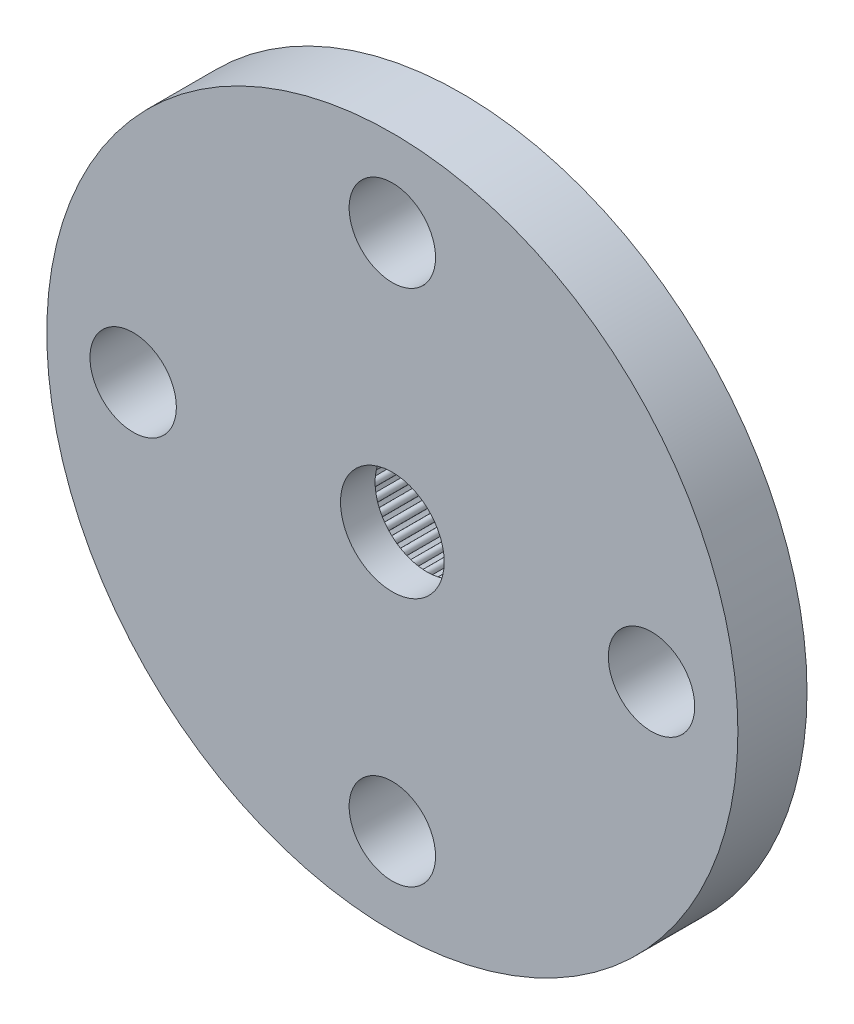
from build123d import *

# Parameters (mm, degrees)
ESQUISSE1_R             = 4.5
BOSS_EXTRU_1_DEPTH      = 3.8
ESQUISSE2_R             = 10
BOSS_EXTRU_2_DEPTH      = 1
ESQUISSE3_R             = 1.25
ESQUISSE3_R_2           = 1.5
ENL_V_MAT_EXTRU_1_DEPTH = 2
ENL_V_START             = -1
ESQUISSE5_R             = 1.5
ENL_V_MAT_EXTRU_2_DEPTH = 1


with BuildPart() as part:
    # Esquisse1 → Boss.-Extru.1 (new body)
    with BuildSketch(Plane.XY):
        with Locations((-10, 0)):
            Circle(ESQUISSE1_R)
        with BuildLine():
            ThreePointArc((-7.001666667, 0.09998611), (-7.004111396, 0.157007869), (-7.007640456, 0.2139728))
            ThreePointArc((-7.007640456, 0.2139728), (-7.115886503, 0.303132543), (-7.028543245, 0.412849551))
            ThreePointArc((-7.028543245, 0.412849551), (-7.036934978, 0.469303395), (-7.046399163, 0.525587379))
            ThreePointArc((-7.046399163, 0.525587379), (-7.163371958, 0.602943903), (-7.087975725, 0.721189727))
            ThreePointArc((-7.087975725, 0.721189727), (-7.102222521, 0.776457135), (-7.117518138, 0.831443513))
            ThreePointArc((-7.117518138, 0.831443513), (-7.241936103, 0.896149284), (-7.179312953, 1.021628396))
            ThreePointArc((-7.179312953, 1.021628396), (-7.199258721, 1.075103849), (-7.220218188, 1.128190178))
            ThreePointArc((-7.220218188, 1.128190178), (-7.350718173, 1.179536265), (-7.301554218, 1.310873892))
            ThreePointArc((-7.301554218, 1.310873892), (-7.326980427, 1.361971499), (-7.353374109, 1.412576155))
            ThreePointArc((-7.353374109, 1.412576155), (-7.488526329, 1.45), (-7.453360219, 1.585757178))
            ThreePointArc((-7.453360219, 1.585757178), (-7.483988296, 1.633917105), (-7.515527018, 1.681485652))
            ThreePointArc((-7.515527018, 1.681485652), (-7.653850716, 1.704577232), (-7.63306774, 1.843266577))
            ThreePointArc((-7.63306774, 1.843266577), (-7.668562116, 1.887961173), (-7.704900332, 1.931972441))
            ThreePointArc((-7.704900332, 1.931972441), (-7.844880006, 1.940478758), (-7.838707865, 2.080580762))
            ThreePointArc((-7.838707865, 2.080580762), (-7.878679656, 2.121320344), (-7.919419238, 2.161292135))
            ThreePointArc((-7.919419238, 2.161292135), (-8.059521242, 2.155119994), (-8.068027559, 2.295099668))
            ThreePointArc((-8.068027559, 2.295099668), (-8.112038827, 2.331437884), (-8.156733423, 2.36693226))
            ThreePointArc((-8.156733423, 2.36693226), (-8.295422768, 2.346149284), (-8.318514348, 2.484472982))
            ThreePointArc((-8.318514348, 2.484472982), (-8.366082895, 2.516011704), (-8.414242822, 2.546639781))
            ThreePointArc((-8.414242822, 2.546639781), (-8.55, 2.511473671), (-8.587423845, 2.646625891))
            ThreePointArc((-8.587423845, 2.646625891), (-8.638028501, 2.673019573), (-8.689126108, 2.698445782))
            ThreePointArc((-8.689126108, 2.698445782), (-8.820463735, 2.649281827), (-8.871809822, 2.779781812))
            ThreePointArc((-8.871809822, 2.779781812), (-8.924896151, 2.800741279), (-8.978371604, 2.820687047))
            ThreePointArc((-8.978371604, 2.820687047), (-9.103850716, 2.758063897), (-9.168556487, 2.882481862))
            ThreePointArc((-9.168556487, 2.882481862), (-9.223542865, 2.897777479), (-9.278810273, 2.912024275))
            ThreePointArc((-9.278810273, 2.912024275), (-9.397056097, 2.836628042), (-9.474412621, 2.953600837))
            ThreePointArc((-9.474412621, 2.953600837), (-9.530696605, 2.963065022), (-9.587150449, 2.971456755))
            ThreePointArc((-9.587150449, 2.971456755), (-9.696867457, 2.884113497), (-9.7860272, 2.992359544))
            ThreePointArc((-9.7860272, 2.992359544), (-9.842992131, 2.995888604), (-9.90001389, 2.998333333))
            ThreePointArc((-9.90001389, 2.998333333), (-10, 2.9), (-10.09998611, 2.998333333))
            ThreePointArc((-10.09998611, 2.998333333), (-10.157007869, 2.995888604), (-10.2139728, 2.992359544))
            ThreePointArc((-10.2139728, 2.992359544), (-10.303132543, 2.884113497), (-10.412849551, 2.971456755))
            ThreePointArc((-10.412849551, 2.971456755), (-10.469303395, 2.963065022), (-10.525587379, 2.953600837))
            ThreePointArc((-10.525587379, 2.953600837), (-10.602943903, 2.836628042), (-10.721189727, 2.912024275))
            ThreePointArc((-10.721189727, 2.912024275), (-10.776457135, 2.897777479), (-10.831443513, 2.882481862))
            ThreePointArc((-10.831443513, 2.882481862), (-10.896149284, 2.758063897), (-11.021628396, 2.820687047))
            ThreePointArc((-11.021628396, 2.820687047), (-11.075103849, 2.800741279), (-11.128190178, 2.779781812))
            ThreePointArc((-11.128190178, 2.779781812), (-11.179536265, 2.649281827), (-11.310873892, 2.698445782))
            ThreePointArc((-11.310873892, 2.698445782), (-11.361971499, 2.673019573), (-11.412576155, 2.646625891))
            ThreePointArc((-11.412576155, 2.646625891), (-11.45, 2.511473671), (-11.585757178, 2.546639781))
            ThreePointArc((-11.585757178, 2.546639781), (-11.633917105, 2.516011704), (-11.681485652, 2.484472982))
            ThreePointArc((-11.681485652, 2.484472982), (-11.704577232, 2.346149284), (-11.843266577, 2.36693226))
            ThreePointArc((-11.843266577, 2.36693226), (-11.887961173, 2.331437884), (-11.931972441, 2.295099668))
            ThreePointArc((-11.931972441, 2.295099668), (-11.940478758, 2.155119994), (-12.080580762, 2.161292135))
            ThreePointArc((-12.080580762, 2.161292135), (-12.121320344, 2.121320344), (-12.161292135, 2.080580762))
            ThreePointArc((-12.161292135, 2.080580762), (-12.155119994, 1.940478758), (-12.295099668, 1.931972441))
            ThreePointArc((-12.295099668, 1.931972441), (-12.331437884, 1.887961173), (-12.36693226, 1.843266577))
            ThreePointArc((-12.36693226, 1.843266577), (-12.346149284, 1.704577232), (-12.484472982, 1.681485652))
            ThreePointArc((-12.484472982, 1.681485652), (-12.516011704, 1.633917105), (-12.546639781, 1.585757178))
            ThreePointArc((-12.546639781, 1.585757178), (-12.511473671, 1.45), (-12.646625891, 1.412576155))
            ThreePointArc((-12.646625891, 1.412576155), (-12.673019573, 1.361971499), (-12.698445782, 1.310873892))
            ThreePointArc((-12.698445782, 1.310873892), (-12.649281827, 1.179536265), (-12.779781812, 1.128190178))
            ThreePointArc((-12.779781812, 1.128190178), (-12.800741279, 1.075103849), (-12.820687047, 1.021628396))
            ThreePointArc((-12.820687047, 1.021628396), (-12.758063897, 0.896149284), (-12.882481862, 0.831443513))
            ThreePointArc((-12.882481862, 0.831443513), (-12.897777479, 0.776457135), (-12.912024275, 0.721189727))
            ThreePointArc((-12.912024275, 0.721189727), (-12.836628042, 0.602943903), (-12.953600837, 0.525587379))
            ThreePointArc((-12.953600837, 0.525587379), (-12.963065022, 0.469303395), (-12.971456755, 0.412849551))
            ThreePointArc((-12.971456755, 0.412849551), (-12.884113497, 0.303132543), (-12.992359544, 0.2139728))
            ThreePointArc((-12.992359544, 0.2139728), (-12.995888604, 0.157007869), (-12.998333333, 0.09998611))
            ThreePointArc((-12.998333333, 0.09998611), (-12.9, 0), (-12.998333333, -0.09998611))
            ThreePointArc((-12.998333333, -0.09998611), (-12.995888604, -0.157007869), (-12.992359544, -0.2139728))
            ThreePointArc((-12.992359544, -0.2139728), (-12.884113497, -0.303132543), (-12.971456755, -0.412849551))
            ThreePointArc((-12.971456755, -0.412849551), (-12.963065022, -0.469303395), (-12.953600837, -0.525587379))
            ThreePointArc((-12.953600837, -0.525587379), (-12.836628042, -0.602943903), (-12.912024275, -0.721189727))
            ThreePointArc((-12.912024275, -0.721189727), (-12.897777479, -0.776457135), (-12.882481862, -0.831443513))
            ThreePointArc((-12.882481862, -0.831443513), (-12.758063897, -0.896149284), (-12.820687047, -1.021628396))
            ThreePointArc((-12.820687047, -1.021628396), (-12.800741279, -1.075103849), (-12.779781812, -1.128190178))
            ThreePointArc((-12.779781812, -1.128190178), (-12.649281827, -1.179536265), (-12.698445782, -1.310873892))
            ThreePointArc((-12.698445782, -1.310873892), (-12.673019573, -1.361971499), (-12.646625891, -1.412576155))
            ThreePointArc((-12.646625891, -1.412576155), (-12.511473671, -1.45), (-12.546639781, -1.585757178))
            ThreePointArc((-12.546639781, -1.585757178), (-12.516011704, -1.633917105), (-12.484472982, -1.681485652))
            ThreePointArc((-12.484472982, -1.681485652), (-12.346149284, -1.704577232), (-12.36693226, -1.843266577))
            ThreePointArc((-12.36693226, -1.843266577), (-12.331437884, -1.887961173), (-12.295099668, -1.931972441))
            ThreePointArc((-12.295099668, -1.931972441), (-12.155119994, -1.940478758), (-12.161292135, -2.080580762))
            ThreePointArc((-12.161292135, -2.080580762), (-12.121320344, -2.121320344), (-12.080580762, -2.161292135))
            ThreePointArc((-12.080580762, -2.161292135), (-11.940478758, -2.155119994), (-11.931972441, -2.295099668))
            ThreePointArc((-11.931972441, -2.295099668), (-11.887961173, -2.331437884), (-11.843266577, -2.36693226))
            ThreePointArc((-11.843266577, -2.36693226), (-11.704577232, -2.346149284), (-11.681485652, -2.484472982))
            ThreePointArc((-11.681485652, -2.484472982), (-11.633917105, -2.516011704), (-11.585757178, -2.546639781))
            ThreePointArc((-11.585757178, -2.546639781), (-11.45, -2.511473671), (-11.412576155, -2.646625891))
            ThreePointArc((-11.412576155, -2.646625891), (-11.361971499, -2.673019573), (-11.310873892, -2.698445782))
            ThreePointArc((-11.310873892, -2.698445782), (-11.179536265, -2.649281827), (-11.128190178, -2.779781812))
            ThreePointArc((-11.128190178, -2.779781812), (-11.075103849, -2.800741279), (-11.021628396, -2.820687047))
            ThreePointArc((-11.021628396, -2.820687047), (-10.896149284, -2.758063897), (-10.831443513, -2.882481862))
            ThreePointArc((-10.831443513, -2.882481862), (-10.776457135, -2.897777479), (-10.721189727, -2.912024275))
            ThreePointArc((-10.721189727, -2.912024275), (-10.602943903, -2.836628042), (-10.525587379, -2.953600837))
            ThreePointArc((-10.525587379, -2.953600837), (-10.469303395, -2.963065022), (-10.412849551, -2.971456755))
            ThreePointArc((-10.412849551, -2.971456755), (-10.303132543, -2.884113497), (-10.2139728, -2.992359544))
            ThreePointArc((-10.2139728, -2.992359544), (-10.157007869, -2.995888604), (-10.09998611, -2.998333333))
            ThreePointArc((-10.09998611, -2.998333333), (-10, -2.9), (-9.90001389, -2.998333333))
            ThreePointArc((-9.90001389, -2.998333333), (-9.842992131, -2.995888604), (-9.7860272, -2.992359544))
            ThreePointArc((-9.7860272, -2.992359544), (-9.696867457, -2.884113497), (-9.587150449, -2.971456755))
            ThreePointArc((-9.587150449, -2.971456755), (-9.530696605, -2.963065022), (-9.474412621, -2.953600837))
            ThreePointArc((-9.474412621, -2.953600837), (-9.397056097, -2.836628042), (-9.278810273, -2.912024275))
            ThreePointArc((-9.278810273, -2.912024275), (-9.223542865, -2.897777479), (-9.168556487, -2.882481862))
            ThreePointArc((-9.168556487, -2.882481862), (-9.103850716, -2.758063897), (-8.978371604, -2.820687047))
            ThreePointArc((-8.978371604, -2.820687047), (-8.924896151, -2.800741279), (-8.871809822, -2.779781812))
            ThreePointArc((-8.871809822, -2.779781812), (-8.820463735, -2.649281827), (-8.689126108, -2.698445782))
            ThreePointArc((-8.689126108, -2.698445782), (-8.638028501, -2.673019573), (-8.587423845, -2.646625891))
            ThreePointArc((-8.587423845, -2.646625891), (-8.55, -2.511473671), (-8.414242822, -2.546639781))
            ThreePointArc((-8.414242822, -2.546639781), (-8.366082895, -2.516011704), (-8.318514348, -2.484472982))
            ThreePointArc((-8.318514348, -2.484472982), (-8.295422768, -2.346149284), (-8.156733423, -2.36693226))
            ThreePointArc((-8.156733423, -2.36693226), (-8.112038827, -2.331437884), (-8.068027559, -2.295099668))
            ThreePointArc((-8.068027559, -2.295099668), (-8.059521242, -2.155119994), (-7.919419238, -2.161292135))
            ThreePointArc((-7.919419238, -2.161292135), (-7.878679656, -2.121320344), (-7.838707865, -2.080580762))
            ThreePointArc((-7.838707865, -2.080580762), (-7.844880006, -1.940478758), (-7.704900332, -1.931972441))
            ThreePointArc((-7.704900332, -1.931972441), (-7.668562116, -1.887961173), (-7.63306774, -1.843266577))
            ThreePointArc((-7.63306774, -1.843266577), (-7.653850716, -1.704577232), (-7.515527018, -1.681485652))
            ThreePointArc((-7.515527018, -1.681485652), (-7.483988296, -1.633917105), (-7.453360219, -1.585757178))
            ThreePointArc((-7.453360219, -1.585757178), (-7.488526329, -1.45), (-7.353374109, -1.412576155))
            ThreePointArc((-7.353374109, -1.412576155), (-7.326980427, -1.361971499), (-7.301554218, -1.310873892))
            ThreePointArc((-7.301554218, -1.310873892), (-7.350718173, -1.179536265), (-7.220218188, -1.128190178))
            ThreePointArc((-7.220218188, -1.128190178), (-7.199258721, -1.075103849), (-7.179312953, -1.021628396))
            ThreePointArc((-7.179312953, -1.021628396), (-7.241936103, -0.896149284), (-7.117518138, -0.831443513))
            ThreePointArc((-7.117518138, -0.831443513), (-7.102222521, -0.776457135), (-7.087975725, -0.721189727))
            ThreePointArc((-7.087975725, -0.721189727), (-7.163371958, -0.602943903), (-7.046399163, -0.525587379))
            ThreePointArc((-7.046399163, -0.525587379), (-7.036934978, -0.469303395), (-7.028543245, -0.412849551))
            ThreePointArc((-7.028543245, -0.412849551), (-7.115886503, -0.303132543), (-7.007640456, -0.2139728))
            ThreePointArc((-7.007640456, -0.2139728), (-7.004111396, -0.157007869), (-7.001666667, -0.09998611))
            ThreePointArc((-7.001666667, -0.09998611), (-7.1, 0), (-7.001666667, 0.09998611))
        make_face(mode=Mode.SUBTRACT)
    extrude(amount=-BOSS_EXTRU_1_DEPTH)

    # Esquisse2 → Boss.-Extru.2 (add, symmetric)
    with BuildSketch(Plane.XY):
        with Locations((-10, 0)):
            Circle(ESQUISSE2_R)
    extrude(amount=BOSS_EXTRU_2_DEPTH, both=True)

    # Esquisse3 → Enl_v. mat.-Extru.1 (cut)
    with BuildSketch(Plane.XY.offset(1)):
        with Locations((-17.5, 0)):
            Circle(ESQUISSE3_R)
        with Locations((-10, 7.5)):
            Circle(ESQUISSE3_R)
        with Locations((-2.5, 0)):
            Circle(ESQUISSE3_R)
        with Locations((-10, -7.5)):
            Circle(ESQUISSE3_R)
        with Locations((-10, 0)):
            Circle(ESQUISSE3_R_2)
    extrude(amount=-ENL_V_MAT_EXTRU_1_DEPTH, mode=Mode.SUBTRACT)

    # Esquisse5 → Enl_v. mat.-Extru.2 (cut)
    with BuildSketch(Plane(origin=(0, 0, -1), x_dir=(-1, 0, 0), z_dir=(0, 0, -1)).offset(ENL_V_START)):
        with BuildLine():
            ThreePointArc((7.007640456, 0.2139728), (7.004111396, 0.157007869), (7.001666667, 0.09998611))
            ThreePointArc((7.001666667, 0.09998611), (7.1, 0), (7.001666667, -0.09998611))
            ThreePointArc((7.001666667, -0.09998611), (7.004111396, -0.157007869), (7.007640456, -0.2139728))
            ThreePointArc((7.007640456, -0.2139728), (7.115886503, -0.303132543), (7.028543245, -0.412849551))
            ThreePointArc((7.028543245, -0.412849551), (7.036934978, -0.469303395), (7.046399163, -0.525587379))
            ThreePointArc((7.046399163, -0.525587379), (7.163371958, -0.602943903), (7.087975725, -0.721189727))
            ThreePointArc((7.087975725, -0.721189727), (7.102222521, -0.776457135), (7.117518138, -0.831443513))
            ThreePointArc((7.117518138, -0.831443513), (7.241936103, -0.896149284), (7.179312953, -1.021628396))
            ThreePointArc((7.179312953, -1.021628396), (7.199258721, -1.075103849), (7.220218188, -1.128190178))
            ThreePointArc((7.220218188, -1.128190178), (7.350718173, -1.179536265), (7.301554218, -1.310873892))
            ThreePointArc((7.301554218, -1.310873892), (7.326980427, -1.361971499), (7.353374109, -1.412576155))
            ThreePointArc((7.353374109, -1.412576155), (7.488526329, -1.45), (7.453360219, -1.585757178))
            ThreePointArc((7.453360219, -1.585757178), (7.483988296, -1.633917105), (7.515527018, -1.681485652))
            ThreePointArc((7.515527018, -1.681485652), (7.653850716, -1.704577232), (7.63306774, -1.843266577))
            ThreePointArc((7.63306774, -1.843266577), (7.668562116, -1.887961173), (7.704900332, -1.931972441))
            ThreePointArc((7.704900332, -1.931972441), (7.844880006, -1.940478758), (7.838707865, -2.080580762))
            ThreePointArc((7.838707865, -2.080580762), (7.878679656, -2.121320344), (7.919419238, -2.161292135))
            ThreePointArc((7.919419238, -2.161292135), (8.059521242, -2.155119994), (8.068027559, -2.295099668))
            ThreePointArc((8.068027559, -2.295099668), (8.112038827, -2.331437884), (8.156733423, -2.36693226))
            ThreePointArc((8.156733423, -2.36693226), (8.295422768, -2.346149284), (8.318514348, -2.484472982))
            ThreePointArc((8.318514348, -2.484472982), (8.366082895, -2.516011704), (8.414242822, -2.546639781))
            ThreePointArc((8.414242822, -2.546639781), (8.55, -2.511473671), (8.587423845, -2.646625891))
            ThreePointArc((8.587423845, -2.646625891), (8.638028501, -2.673019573), (8.689126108, -2.698445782))
            ThreePointArc((8.689126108, -2.698445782), (8.820463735, -2.649281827), (8.871809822, -2.779781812))
            ThreePointArc((8.871809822, -2.779781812), (8.924896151, -2.800741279), (8.978371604, -2.820687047))
            ThreePointArc((8.978371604, -2.820687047), (9.103850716, -2.758063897), (9.168556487, -2.882481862))
            ThreePointArc((9.168556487, -2.882481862), (9.223542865, -2.897777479), (9.278810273, -2.912024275))
            ThreePointArc((9.278810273, -2.912024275), (9.397056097, -2.836628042), (9.474412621, -2.953600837))
            ThreePointArc((9.474412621, -2.953600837), (9.530696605, -2.963065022), (9.587150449, -2.971456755))
            ThreePointArc((9.587150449, -2.971456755), (9.696867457, -2.884113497), (9.7860272, -2.992359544))
            ThreePointArc((9.7860272, -2.992359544), (9.842992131, -2.995888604), (9.90001389, -2.998333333))
            ThreePointArc((9.90001389, -2.998333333), (10, -2.9), (10.09998611, -2.998333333))
            ThreePointArc((10.09998611, -2.998333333), (10.157007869, -2.995888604), (10.2139728, -2.992359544))
            ThreePointArc((10.2139728, -2.992359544), (10.303132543, -2.884113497), (10.412849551, -2.971456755))
            ThreePointArc((10.412849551, -2.971456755), (10.469303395, -2.963065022), (10.525587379, -2.953600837))
            ThreePointArc((10.525587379, -2.953600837), (10.602943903, -2.836628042), (10.721189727, -2.912024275))
            ThreePointArc((10.721189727, -2.912024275), (10.776457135, -2.897777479), (10.831443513, -2.882481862))
            ThreePointArc((10.831443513, -2.882481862), (10.896149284, -2.758063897), (11.021628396, -2.820687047))
            ThreePointArc((11.021628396, -2.820687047), (11.075103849, -2.800741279), (11.128190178, -2.779781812))
            ThreePointArc((11.128190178, -2.779781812), (11.179536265, -2.649281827), (11.310873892, -2.698445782))
            ThreePointArc((11.310873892, -2.698445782), (11.361971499, -2.673019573), (11.412576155, -2.646625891))
            ThreePointArc((11.412576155, -2.646625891), (11.45, -2.511473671), (11.585757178, -2.546639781))
            ThreePointArc((11.585757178, -2.546639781), (11.633917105, -2.516011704), (11.681485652, -2.484472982))
            ThreePointArc((11.681485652, -2.484472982), (11.704577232, -2.346149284), (11.843266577, -2.36693226))
            ThreePointArc((11.843266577, -2.36693226), (11.887961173, -2.331437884), (11.931972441, -2.295099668))
            ThreePointArc((11.931972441, -2.295099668), (11.940478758, -2.155119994), (12.080580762, -2.161292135))
            ThreePointArc((12.080580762, -2.161292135), (12.121320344, -2.121320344), (12.161292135, -2.080580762))
            ThreePointArc((12.161292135, -2.080580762), (12.155119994, -1.940478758), (12.295099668, -1.931972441))
            ThreePointArc((12.295099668, -1.931972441), (12.331437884, -1.887961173), (12.36693226, -1.843266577))
            ThreePointArc((12.36693226, -1.843266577), (12.346149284, -1.704577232), (12.484472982, -1.681485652))
            ThreePointArc((12.484472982, -1.681485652), (12.516011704, -1.633917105), (12.546639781, -1.585757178))
            ThreePointArc((12.546639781, -1.585757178), (12.511473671, -1.45), (12.646625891, -1.412576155))
            ThreePointArc((12.646625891, -1.412576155), (12.673019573, -1.361971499), (12.698445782, -1.310873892))
            ThreePointArc((12.698445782, -1.310873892), (12.649281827, -1.179536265), (12.779781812, -1.128190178))
            ThreePointArc((12.779781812, -1.128190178), (12.800741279, -1.075103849), (12.820687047, -1.021628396))
            ThreePointArc((12.820687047, -1.021628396), (12.758063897, -0.896149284), (12.882481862, -0.831443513))
            ThreePointArc((12.882481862, -0.831443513), (12.897777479, -0.776457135), (12.912024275, -0.721189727))
            ThreePointArc((12.912024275, -0.721189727), (12.836628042, -0.602943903), (12.953600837, -0.525587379))
            ThreePointArc((12.953600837, -0.525587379), (12.963065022, -0.469303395), (12.971456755, -0.412849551))
            ThreePointArc((12.971456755, -0.412849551), (12.884113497, -0.303132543), (12.992359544, -0.2139728))
            ThreePointArc((12.992359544, -0.2139728), (12.995888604, -0.157007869), (12.998333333, -0.09998611))
            ThreePointArc((12.998333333, -0.09998611), (12.9, 0), (12.998333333, 0.09998611))
            ThreePointArc((12.998333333, 0.09998611), (12.995888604, 0.157007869), (12.992359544, 0.2139728))
            ThreePointArc((12.992359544, 0.2139728), (12.884113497, 0.303132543), (12.971456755, 0.412849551))
            ThreePointArc((12.971456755, 0.412849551), (12.963065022, 0.469303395), (12.953600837, 0.525587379))
            ThreePointArc((12.953600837, 0.525587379), (12.836628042, 0.602943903), (12.912024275, 0.721189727))
            ThreePointArc((12.912024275, 0.721189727), (12.897777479, 0.776457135), (12.882481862, 0.831443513))
            ThreePointArc((12.882481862, 0.831443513), (12.758063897, 0.896149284), (12.820687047, 1.021628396))
            ThreePointArc((12.820687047, 1.021628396), (12.800741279, 1.075103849), (12.779781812, 1.128190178))
            ThreePointArc((12.779781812, 1.128190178), (12.649281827, 1.179536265), (12.698445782, 1.310873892))
            ThreePointArc((12.698445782, 1.310873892), (12.673019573, 1.361971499), (12.646625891, 1.412576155))
            ThreePointArc((12.646625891, 1.412576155), (12.511473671, 1.45), (12.546639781, 1.585757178))
            ThreePointArc((12.546639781, 1.585757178), (12.516011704, 1.633917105), (12.484472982, 1.681485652))
            ThreePointArc((12.484472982, 1.681485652), (12.346149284, 1.704577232), (12.36693226, 1.843266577))
            ThreePointArc((12.36693226, 1.843266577), (12.331437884, 1.887961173), (12.295099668, 1.931972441))
            ThreePointArc((12.295099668, 1.931972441), (12.155119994, 1.940478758), (12.161292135, 2.080580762))
            ThreePointArc((12.161292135, 2.080580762), (12.121320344, 2.121320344), (12.080580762, 2.161292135))
            ThreePointArc((12.080580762, 2.161292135), (11.940478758, 2.155119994), (11.931972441, 2.295099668))
            ThreePointArc((11.931972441, 2.295099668), (11.887961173, 2.331437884), (11.843266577, 2.36693226))
            ThreePointArc((11.843266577, 2.36693226), (11.704577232, 2.346149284), (11.681485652, 2.484472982))
            ThreePointArc((11.681485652, 2.484472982), (11.633917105, 2.516011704), (11.585757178, 2.546639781))
            ThreePointArc((11.585757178, 2.546639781), (11.45, 2.511473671), (11.412576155, 2.646625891))
            ThreePointArc((11.412576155, 2.646625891), (11.361971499, 2.673019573), (11.310873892, 2.698445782))
            ThreePointArc((11.310873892, 2.698445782), (11.179536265, 2.649281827), (11.128190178, 2.779781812))
            ThreePointArc((11.128190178, 2.779781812), (11.075103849, 2.800741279), (11.021628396, 2.820687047))
            ThreePointArc((11.021628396, 2.820687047), (10.896149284, 2.758063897), (10.831443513, 2.882481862))
            ThreePointArc((10.831443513, 2.882481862), (10.776457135, 2.897777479), (10.721189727, 2.912024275))
            ThreePointArc((10.721189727, 2.912024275), (10.602943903, 2.836628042), (10.525587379, 2.953600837))
            ThreePointArc((10.525587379, 2.953600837), (10.469303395, 2.963065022), (10.412849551, 2.971456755))
            ThreePointArc((10.412849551, 2.971456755), (10.303132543, 2.884113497), (10.2139728, 2.992359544))
            ThreePointArc((10.2139728, 2.992359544), (10.157007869, 2.995888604), (10.09998611, 2.998333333))
            ThreePointArc((10.09998611, 2.998333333), (10, 2.9), (9.90001389, 2.998333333))
            ThreePointArc((9.90001389, 2.998333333), (9.842992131, 2.995888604), (9.7860272, 2.992359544))
            ThreePointArc((9.7860272, 2.992359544), (9.696867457, 2.884113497), (9.587150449, 2.971456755))
            ThreePointArc((9.587150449, 2.971456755), (9.530696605, 2.963065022), (9.474412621, 2.953600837))
            ThreePointArc((9.474412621, 2.953600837), (9.397056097, 2.836628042), (9.278810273, 2.912024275))
            ThreePointArc((9.278810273, 2.912024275), (9.223542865, 2.897777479), (9.168556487, 2.882481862))
            ThreePointArc((9.168556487, 2.882481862), (9.103850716, 2.758063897), (8.978371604, 2.820687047))
            ThreePointArc((8.978371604, 2.820687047), (8.924896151, 2.800741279), (8.871809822, 2.779781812))
            ThreePointArc((8.871809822, 2.779781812), (8.820463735, 2.649281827), (8.689126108, 2.698445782))
            ThreePointArc((8.689126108, 2.698445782), (8.638028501, 2.673019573), (8.587423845, 2.646625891))
            ThreePointArc((8.587423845, 2.646625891), (8.55, 2.511473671), (8.414242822, 2.546639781))
            ThreePointArc((8.414242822, 2.546639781), (8.366082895, 2.516011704), (8.318514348, 2.484472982))
            ThreePointArc((8.318514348, 2.484472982), (8.295422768, 2.346149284), (8.156733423, 2.36693226))
            ThreePointArc((8.156733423, 2.36693226), (8.112038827, 2.331437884), (8.068027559, 2.295099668))
            ThreePointArc((8.068027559, 2.295099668), (8.059521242, 2.155119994), (7.919419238, 2.161292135))
            ThreePointArc((7.919419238, 2.161292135), (7.878679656, 2.121320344), (7.838707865, 2.080580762))
            ThreePointArc((7.838707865, 2.080580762), (7.844880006, 1.940478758), (7.704900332, 1.931972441))
            ThreePointArc((7.704900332, 1.931972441), (7.668562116, 1.887961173), (7.63306774, 1.843266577))
            ThreePointArc((7.63306774, 1.843266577), (7.653850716, 1.704577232), (7.515527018, 1.681485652))
            ThreePointArc((7.515527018, 1.681485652), (7.483988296, 1.633917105), (7.453360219, 1.585757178))
            ThreePointArc((7.453360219, 1.585757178), (7.488526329, 1.45), (7.353374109, 1.412576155))
            ThreePointArc((7.353374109, 1.412576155), (7.326980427, 1.361971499), (7.301554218, 1.310873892))
            ThreePointArc((7.301554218, 1.310873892), (7.350718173, 1.179536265), (7.220218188, 1.128190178))
            ThreePointArc((7.220218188, 1.128190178), (7.199258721, 1.075103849), (7.179312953, 1.021628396))
            ThreePointArc((7.179312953, 1.021628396), (7.241936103, 0.896149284), (7.117518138, 0.831443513))
            ThreePointArc((7.117518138, 0.831443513), (7.102222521, 0.776457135), (7.087975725, 0.721189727))
            ThreePointArc((7.087975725, 0.721189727), (7.163371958, 0.602943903), (7.046399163, 0.525587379))
            ThreePointArc((7.046399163, 0.525587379), (7.036934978, 0.469303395), (7.028543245, 0.412849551))
            ThreePointArc((7.028543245, 0.412849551), (7.115886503, 0.303132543), (7.007640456, 0.2139728))
        make_face()
        with Locations(Location((10, 0, 0), (0, 0, 180))):
            Circle(ESQUISSE5_R, mode=Mode.SUBTRACT)
    extrude(amount=ENL_V_MAT_EXTRU_2_DEPTH, mode=Mode.SUBTRACT)


solid = part.part
